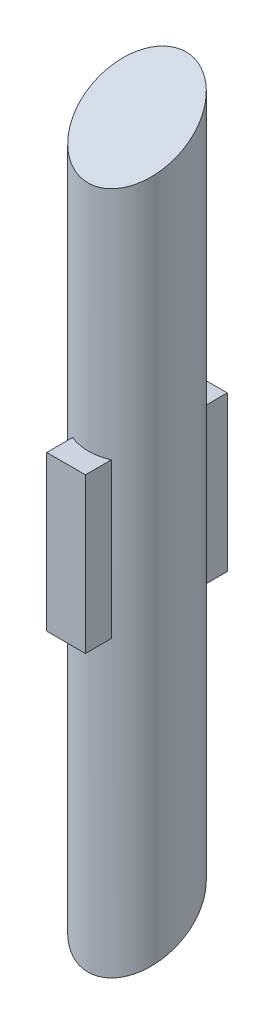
ISO-10303-21;
HEADER;
FILE_DESCRIPTION(('STEP AP214'),'2;1');
FILE_NAME('part.step','',(''),(''),'','','');
FILE_SCHEMA(('AUTOMOTIVE_DESIGN { 1 0 10303 214 1 1 1 1 }'));
ENDSEC;
DATA;
#1=APPLICATION_CONTEXT('core data for automotive mechanical design processes');
#2=APPLICATION_PROTOCOL_DEFINITION('international standard','automotive_design',2000,#1);
#3=PRODUCT_CONTEXT('',#1,'mechanical');
#4=PRODUCT('Part','Part','',(#3));
#5=PRODUCT_RELATED_PRODUCT_CATEGORY('part','',(#4));
#6=PRODUCT_DEFINITION_FORMATION('','',#4);
#7=PRODUCT_DEFINITION_CONTEXT('part definition',#1,'design');
#8=PRODUCT_DEFINITION('design','',#6,#7);
#9=PRODUCT_DEFINITION_SHAPE('','',#8);
#10=(LENGTH_UNIT() NAMED_UNIT(*) SI_UNIT(.MILLI.,.METRE.));
#11=(NAMED_UNIT(*) PLANE_ANGLE_UNIT() SI_UNIT($,.RADIAN.));
#12=(NAMED_UNIT(*) SI_UNIT($,.STERADIAN.) SOLID_ANGLE_UNIT());
#13=UNCERTAINTY_MEASURE_WITH_UNIT(LENGTH_MEASURE(1.E-05),#10,'distance_accuracy_value','');
#14=(GEOMETRIC_REPRESENTATION_CONTEXT(3) GLOBAL_UNCERTAINTY_ASSIGNED_CONTEXT((#13)) GLOBAL_UNIT_ASSIGNED_CONTEXT((#10,
#11,#12)) REPRESENTATION_CONTEXT('',''));
#15=CARTESIAN_POINT('',(0.,0.,0.));
#16=DIRECTION('',(0.,0.,1.));
#17=DIRECTION('',(1.,0.,0.));
#18=AXIS2_PLACEMENT_3D('',#15,#16,#17);
#19=CARTESIAN_POINT('',(0.,-14.5,0.));
#20=DIRECTION('',(0.,1.,0.));
#21=DIRECTION('',(0.,0.,1.));
#22=AXIS2_PLACEMENT_3D('',#19,#20,#21);
#23=CYLINDRICAL_SURFACE('',#22,1.9);
#24=CARTESIAN_POINT('',(0.,13.25,0.));
#25=DIRECTION('',(0.,-0.83541708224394,-0.549616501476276));
#26=DIRECTION('',(0.,0.549616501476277,-0.83541708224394));
#27=AXIS2_PLACEMENT_3D('',#24,#25,#26);
#28=ELLIPSE('',#27,2.27431308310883,1.9);
#29=CARTESIAN_POINT('',(0.,14.5,-1.9));
#30=VERTEX_POINT('',#29);
#31=EDGE_CURVE('E196',#30,#30,#28,.F.);
#32=ORIENTED_EDGE('',*,*,#31,.F.);
#33=EDGE_LOOP('',(#32));
#34=FACE_BOUND('',#33,.T.);
#35=CARTESIAN_POINT('',(0.,-13.25,0.));
#36=DIRECTION('',(0.,0.83541708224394,0.549616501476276));
#37=DIRECTION('',(0.,0.549616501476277,-0.83541708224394));
#38=AXIS2_PLACEMENT_3D('',#35,#36,#37);
#39=ELLIPSE('',#38,2.27431308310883,1.9);
#40=CARTESIAN_POINT('',(0.,-12.,-1.9));
#41=VERTEX_POINT('',#40);
#42=EDGE_CURVE('E123',#41,#41,#39,.F.);
#43=ORIENTED_EDGE('',*,*,#42,.F.);
#44=EDGE_LOOP('',(#43));
#45=FACE_BOUND('',#44,.T.);
#46=CARTESIAN_POINT('',(0.,3.,0.));
#47=DIRECTION('',(0.,1.,0.));
#48=DIRECTION('',(0.,0.,1.));
#49=AXIS2_PLACEMENT_3D('',#46,#47,#48);
#50=CIRCLE('',#49,1.9);
#51=CARTESIAN_POINT('',(0.75,3.,-1.74570902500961));
#52=VERTEX_POINT('',#51);
#53=CARTESIAN_POINT('',(-0.75,3.,-1.74570902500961));
#54=VERTEX_POINT('',#53);
#55=EDGE_CURVE('E128',#52,#54,#50,.T.);
#56=ORIENTED_EDGE('',*,*,#55,.T.);
#57=DIRECTION('',(0.,-1.,0.));
#58=VECTOR('',#57,1.);
#59=CARTESIAN_POINT('',(-0.75,3.,-1.74570902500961));
#60=LINE('',#59,#58);
#61=CARTESIAN_POINT('',(-0.75,-3.,-1.74570902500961));
#62=VERTEX_POINT('',#61);
#63=EDGE_CURVE('E136',#54,#62,#60,.T.);
#64=ORIENTED_EDGE('',*,*,#63,.T.);
#65=CARTESIAN_POINT('',(0.,-3.,0.));
#66=DIRECTION('',(0.,1.,0.));
#67=DIRECTION('',(0.,0.,1.));
#68=AXIS2_PLACEMENT_3D('',#65,#66,#67);
#69=CIRCLE('',#68,1.9);
#70=CARTESIAN_POINT('',(0.75,-3.,-1.74570902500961));
#71=VERTEX_POINT('',#70);
#72=EDGE_CURVE('E121',#71,#62,#69,.T.);
#73=ORIENTED_EDGE('',*,*,#72,.F.);
#74=DIRECTION('',(0.,-1.,0.));
#75=VECTOR('',#74,1.);
#76=CARTESIAN_POINT('',(0.75,3.,-1.74570902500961));
#77=LINE('',#76,#75);
#78=EDGE_CURVE('E111',#52,#71,#77,.T.);
#79=ORIENTED_EDGE('',*,*,#78,.F.);
#80=EDGE_LOOP('',(#56,#64,#73,#79));
#81=FACE_BOUND('',#80,.T.);
#82=DIRECTION('',(0.,1.,0.));
#83=VECTOR('',#82,1.);
#84=CARTESIAN_POINT('',(0.75,-3.,1.74570902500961));
#85=LINE('',#84,#83);
#86=CARTESIAN_POINT('',(0.75,-3.,1.74570902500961));
#87=VERTEX_POINT('',#86);
#88=CARTESIAN_POINT('',(0.75,3.,1.74570902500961));
#89=VERTEX_POINT('',#88);
#90=EDGE_CURVE('E11',#87,#89,#85,.T.);
#91=ORIENTED_EDGE('',*,*,#90,.F.);
#92=CARTESIAN_POINT('',(0.,-3.,0.));
#93=DIRECTION('',(0.,1.,0.));
#94=DIRECTION('',(0.,0.,1.));
#95=AXIS2_PLACEMENT_3D('',#92,#93,#94);
#96=CIRCLE('',#95,1.9);
#97=CARTESIAN_POINT('',(-0.75,-3.,1.74570902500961));
#98=VERTEX_POINT('',#97);
#99=EDGE_CURVE('E152',#98,#87,#96,.T.);
#100=ORIENTED_EDGE('',*,*,#99,.F.);
#101=DIRECTION('',(0.,1.,0.));
#102=VECTOR('',#101,1.);
#103=CARTESIAN_POINT('',(-0.75,-3.,1.74570902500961));
#104=LINE('',#103,#102);
#105=CARTESIAN_POINT('',(-0.75,3.,1.74570902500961));
#106=VERTEX_POINT('',#105);
#107=EDGE_CURVE('E40',#98,#106,#104,.T.);
#108=ORIENTED_EDGE('',*,*,#107,.T.);
#109=CARTESIAN_POINT('',(0.,3.,0.));
#110=DIRECTION('',(0.,1.,0.));
#111=DIRECTION('',(0.,0.,1.));
#112=AXIS2_PLACEMENT_3D('',#109,#110,#111);
#113=CIRCLE('',#112,1.9);
#114=EDGE_CURVE('E141',#106,#89,#113,.T.);
#115=ORIENTED_EDGE('',*,*,#114,.T.);
#116=EDGE_LOOP('',(#91,#100,#108,#115));
#117=FACE_BOUND('',#116,.T.);
#118=ADVANCED_FACE('F37',(#34,#45,#81,#117),#23,.T.);
#119=CARTESIAN_POINT('',(0.75,-3.,0.));
#120=DIRECTION('',(-1.,0.,0.));
#121=DIRECTION('',(0.,0.,1.));
#122=AXIS2_PLACEMENT_3D('',#119,#120,#121);
#123=PLANE('',#122);
#124=DIRECTION('',(0.,0.,1.));
#125=VECTOR('',#124,1.);
#126=CARTESIAN_POINT('',(0.75,3.,0.));
#127=LINE('',#126,#125);
#128=CARTESIAN_POINT('',(0.75,3.,2.75));
#129=VERTEX_POINT('',#128);
#130=EDGE_CURVE('E149',#89,#129,#127,.T.);
#131=ORIENTED_EDGE('',*,*,#130,.T.);
#132=DIRECTION('',(0.,1.,0.));
#133=VECTOR('',#132,1.);
#134=CARTESIAN_POINT('',(0.75,-3.,2.75));
#135=LINE('',#134,#133);
#136=CARTESIAN_POINT('',(0.75,-3.,2.75));
#137=VERTEX_POINT('',#136);
#138=EDGE_CURVE('E45',#137,#129,#135,.T.);
#139=ORIENTED_EDGE('',*,*,#138,.F.);
#140=DIRECTION('',(0.,0.,1.));
#141=VECTOR('',#140,1.);
#142=CARTESIAN_POINT('',(0.75,-3.,0.));
#143=LINE('',#142,#141);
#144=EDGE_CURVE('E161',#87,#137,#143,.T.);
#145=ORIENTED_EDGE('',*,*,#144,.F.);
#146=ORIENTED_EDGE('',*,*,#90,.T.);
#147=EDGE_LOOP('',(#131,#139,#145,#146));
#148=FACE_BOUND('',#147,.T.);
#149=ADVANCED_FACE('F176',(#148),#123,.F.);
#150=CARTESIAN_POINT('',(0.,-3.,2.75));
#151=DIRECTION('',(0.,0.,1.));
#152=DIRECTION('',(1.,0.,0.));
#153=AXIS2_PLACEMENT_3D('',#150,#151,#152);
#154=PLANE('',#153);
#155=DIRECTION('',(1.,0.,0.));
#156=VECTOR('',#155,1.);
#157=CARTESIAN_POINT('',(0.,3.,2.75));
#158=LINE('',#157,#156);
#159=CARTESIAN_POINT('',(-0.75,3.,2.75));
#160=VERTEX_POINT('',#159);
#161=EDGE_CURVE('E146',#160,#129,#158,.T.);
#162=ORIENTED_EDGE('',*,*,#161,.F.);
#163=DIRECTION('',(0.,1.,0.));
#164=VECTOR('',#163,1.);
#165=CARTESIAN_POINT('',(-0.75,-3.,2.75));
#166=LINE('',#165,#164);
#167=CARTESIAN_POINT('',(-0.75,-3.,2.75));
#168=VERTEX_POINT('',#167);
#169=EDGE_CURVE('E163',#168,#160,#166,.T.);
#170=ORIENTED_EDGE('',*,*,#169,.F.);
#171=DIRECTION('',(1.,0.,0.));
#172=VECTOR('',#171,1.);
#173=CARTESIAN_POINT('',(0.,-3.,2.75));
#174=LINE('',#173,#172);
#175=EDGE_CURVE('E158',#168,#137,#174,.T.);
#176=ORIENTED_EDGE('',*,*,#175,.T.);
#177=ORIENTED_EDGE('',*,*,#138,.T.);
#178=EDGE_LOOP('',(#162,#170,#176,#177));
#179=FACE_BOUND('',#178,.T.);
#180=ADVANCED_FACE('F181',(#179),#154,.T.);
#181=CARTESIAN_POINT('',(-0.75,-3.,0.));
#182=DIRECTION('',(-1.,0.,0.));
#183=DIRECTION('',(0.,0.,1.));
#184=AXIS2_PLACEMENT_3D('',#181,#182,#183);
#185=PLANE('',#184);
#186=DIRECTION('',(0.,0.,1.));
#187=VECTOR('',#186,1.);
#188=CARTESIAN_POINT('',(-0.75,3.,0.));
#189=LINE('',#188,#187);
#190=EDGE_CURVE('E143',#106,#160,#189,.T.);
#191=ORIENTED_EDGE('',*,*,#190,.F.);
#192=ORIENTED_EDGE('',*,*,#107,.F.);
#193=DIRECTION('',(0.,0.,1.));
#194=VECTOR('',#193,1.);
#195=CARTESIAN_POINT('',(-0.75,-3.,0.));
#196=LINE('',#195,#194);
#197=EDGE_CURVE('E155',#98,#168,#196,.T.);
#198=ORIENTED_EDGE('',*,*,#197,.T.);
#199=ORIENTED_EDGE('',*,*,#169,.T.);
#200=EDGE_LOOP('',(#191,#192,#198,#199));
#201=FACE_BOUND('',#200,.T.);
#202=ADVANCED_FACE('F169',(#201),#185,.T.);
#203=CARTESIAN_POINT('',(0.,-3.,0.));
#204=DIRECTION('',(0.,1.,0.));
#205=DIRECTION('',(0.,0.,1.));
#206=AXIS2_PLACEMENT_3D('',#203,#204,#205);
#207=PLANE('',#206);
#208=ORIENTED_EDGE('',*,*,#99,.T.);
#209=ORIENTED_EDGE('',*,*,#144,.T.);
#210=ORIENTED_EDGE('',*,*,#175,.F.);
#211=ORIENTED_EDGE('',*,*,#197,.F.);
#212=EDGE_LOOP('',(#208,#209,#210,#211));
#213=FACE_BOUND('',#212,.T.);
#214=ADVANCED_FACE('F179',(#213),#207,.F.);
#215=CARTESIAN_POINT('',(0.,3.,0.));
#216=DIRECTION('',(0.,1.,0.));
#217=DIRECTION('',(0.,0.,1.));
#218=AXIS2_PLACEMENT_3D('',#215,#216,#217);
#219=PLANE('',#218);
#220=ORIENTED_EDGE('',*,*,#114,.F.);
#221=ORIENTED_EDGE('',*,*,#190,.T.);
#222=ORIENTED_EDGE('',*,*,#161,.T.);
#223=ORIENTED_EDGE('',*,*,#130,.F.);
#224=EDGE_LOOP('',(#220,#221,#222,#223));
#225=FACE_BOUND('',#224,.T.);
#226=ADVANCED_FACE('F173',(#225),#219,.T.);
#227=CARTESIAN_POINT('',(0.75,3.,0.));
#228=DIRECTION('',(1.,0.,0.));
#229=DIRECTION('',(0.,0.,-1.));
#230=AXIS2_PLACEMENT_3D('',#227,#228,#229);
#231=PLANE('',#230);
#232=ORIENTED_EDGE('',*,*,#78,.T.);
#233=DIRECTION('',(0.,0.,1.));
#234=VECTOR('',#233,1.);
#235=CARTESIAN_POINT('',(0.75,-3.,0.));
#236=LINE('',#235,#234);
#237=CARTESIAN_POINT('',(0.75,-3.,-2.75));
#238=VERTEX_POINT('',#237);
#239=EDGE_CURVE('E53',#238,#71,#236,.T.);
#240=ORIENTED_EDGE('',*,*,#239,.F.);
#241=DIRECTION('',(0.,-1.,0.));
#242=VECTOR('',#241,1.);
#243=CARTESIAN_POINT('',(0.75,3.,-2.75));
#244=LINE('',#243,#242);
#245=CARTESIAN_POINT('',(0.75,3.,-2.75));
#246=VERTEX_POINT('',#245);
#247=EDGE_CURVE('E102',#246,#238,#244,.T.);
#248=ORIENTED_EDGE('',*,*,#247,.F.);
#249=DIRECTION('',(0.,0.,1.));
#250=VECTOR('',#249,1.);
#251=CARTESIAN_POINT('',(0.75,3.,0.));
#252=LINE('',#251,#250);
#253=EDGE_CURVE('E131',#246,#52,#252,.T.);
#254=ORIENTED_EDGE('',*,*,#253,.T.);
#255=EDGE_LOOP('',(#232,#240,#248,#254));
#256=FACE_BOUND('',#255,.T.);
#257=ADVANCED_FACE('F118',(#256),#231,.T.);
#258=CARTESIAN_POINT('',(0.,3.,-2.75));
#259=DIRECTION('',(0.,0.,-1.));
#260=DIRECTION('',(-1.,0.,0.));
#261=AXIS2_PLACEMENT_3D('',#258,#259,#260);
#262=PLANE('',#261);
#263=ORIENTED_EDGE('',*,*,#247,.T.);
#264=DIRECTION('',(1.,0.,0.));
#265=VECTOR('',#264,1.);
#266=CARTESIAN_POINT('',(0.,-3.,-2.75));
#267=LINE('',#266,#265);
#268=CARTESIAN_POINT('',(-0.75,-3.,-2.75));
#269=VERTEX_POINT('',#268);
#270=EDGE_CURVE('E104',#269,#238,#267,.T.);
#271=ORIENTED_EDGE('',*,*,#270,.F.);
#272=DIRECTION('',(0.,-1.,0.));
#273=VECTOR('',#272,1.);
#274=CARTESIAN_POINT('',(-0.75,3.,-2.75));
#275=LINE('',#274,#273);
#276=CARTESIAN_POINT('',(-0.75,3.,-2.75));
#277=VERTEX_POINT('',#276);
#278=EDGE_CURVE('E112',#277,#269,#275,.T.);
#279=ORIENTED_EDGE('',*,*,#278,.F.);
#280=DIRECTION('',(1.,0.,0.));
#281=VECTOR('',#280,1.);
#282=CARTESIAN_POINT('',(0.,3.,-2.75));
#283=LINE('',#282,#281);
#284=EDGE_CURVE('E107',#277,#246,#283,.T.);
#285=ORIENTED_EDGE('',*,*,#284,.T.);
#286=EDGE_LOOP('',(#263,#271,#279,#285));
#287=FACE_BOUND('',#286,.T.);
#288=ADVANCED_FACE('F103',(#287),#262,.T.);
#289=CARTESIAN_POINT('',(-0.75,3.,0.));
#290=DIRECTION('',(1.,0.,0.));
#291=DIRECTION('',(0.,0.,-1.));
#292=AXIS2_PLACEMENT_3D('',#289,#290,#291);
#293=PLANE('',#292);
#294=ORIENTED_EDGE('',*,*,#278,.T.);
#295=DIRECTION('',(0.,0.,1.));
#296=VECTOR('',#295,1.);
#297=CARTESIAN_POINT('',(-0.75,-3.,0.));
#298=LINE('',#297,#296);
#299=EDGE_CURVE('E116',#269,#62,#298,.T.);
#300=ORIENTED_EDGE('',*,*,#299,.T.);
#301=ORIENTED_EDGE('',*,*,#63,.F.);
#302=DIRECTION('',(0.,0.,1.));
#303=VECTOR('',#302,1.);
#304=CARTESIAN_POINT('',(-0.75,3.,0.));
#305=LINE('',#304,#303);
#306=EDGE_CURVE('E134',#277,#54,#305,.T.);
#307=ORIENTED_EDGE('',*,*,#306,.F.);
#308=EDGE_LOOP('',(#294,#300,#301,#307));
#309=FACE_BOUND('',#308,.T.);
#310=ADVANCED_FACE('F205',(#309),#293,.F.);
#311=CARTESIAN_POINT('',(0.,3.,0.));
#312=DIRECTION('',(0.,1.,0.));
#313=DIRECTION('',(0.,0.,1.));
#314=AXIS2_PLACEMENT_3D('',#311,#312,#313);
#315=PLANE('',#314);
#316=ORIENTED_EDGE('',*,*,#55,.F.);
#317=ORIENTED_EDGE('',*,*,#253,.F.);
#318=ORIENTED_EDGE('',*,*,#284,.F.);
#319=ORIENTED_EDGE('',*,*,#306,.T.);
#320=EDGE_LOOP('',(#316,#317,#318,#319));
#321=FACE_BOUND('',#320,.T.);
#322=ADVANCED_FACE('F202',(#321),#315,.T.);
#323=CARTESIAN_POINT('',(0.,-3.,0.));
#324=DIRECTION('',(0.,1.,0.));
#325=DIRECTION('',(0.,0.,1.));
#326=AXIS2_PLACEMENT_3D('',#323,#324,#325);
#327=PLANE('',#326);
#328=ORIENTED_EDGE('',*,*,#72,.T.);
#329=ORIENTED_EDGE('',*,*,#299,.F.);
#330=ORIENTED_EDGE('',*,*,#270,.T.);
#331=ORIENTED_EDGE('',*,*,#239,.T.);
#332=EDGE_LOOP('',(#328,#329,#330,#331));
#333=FACE_BOUND('',#332,.T.);
#334=ADVANCED_FACE('F114',(#333),#327,.F.);
#335=CARTESIAN_POINT('',(-1.9,-12.,-1.9));
#336=DIRECTION('',(0.,0.83541708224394,0.549616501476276));
#337=DIRECTION('',(0.,-0.549616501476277,0.83541708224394));
#338=AXIS2_PLACEMENT_3D('',#335,#336,#337);
#339=PLANE('',#338);
#340=ORIENTED_EDGE('',*,*,#42,.T.);
#341=EDGE_LOOP('',(#340));
#342=FACE_BOUND('',#341,.T.);
#343=ADVANCED_FACE('F257',(#342),#339,.F.);
#344=CARTESIAN_POINT('',(-1.9,14.5,-1.9));
#345=DIRECTION('',(0.,-0.83541708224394,-0.549616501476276));
#346=DIRECTION('',(0.,0.549616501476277,-0.83541708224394));
#347=AXIS2_PLACEMENT_3D('',#344,#345,#346);
#348=PLANE('',#347);
#349=ORIENTED_EDGE('',*,*,#31,.T.);
#350=EDGE_LOOP('',(#349));
#351=FACE_BOUND('',#350,.T.);
#352=ADVANCED_FACE('F270',(#351),#348,.F.);
#353=CLOSED_SHELL('',(#118,#149,#180,#202,#214,#226,#257,#288,#310,#322,#334,#343,#352));
#354=MANIFOLD_SOLID_BREP('B2',#353);
#355=ADVANCED_BREP_SHAPE_REPRESENTATION('',(#18,#354),#14);
#356=SHAPE_DEFINITION_REPRESENTATION(#9,#355);
ENDSEC;
END-ISO-10303-21;
